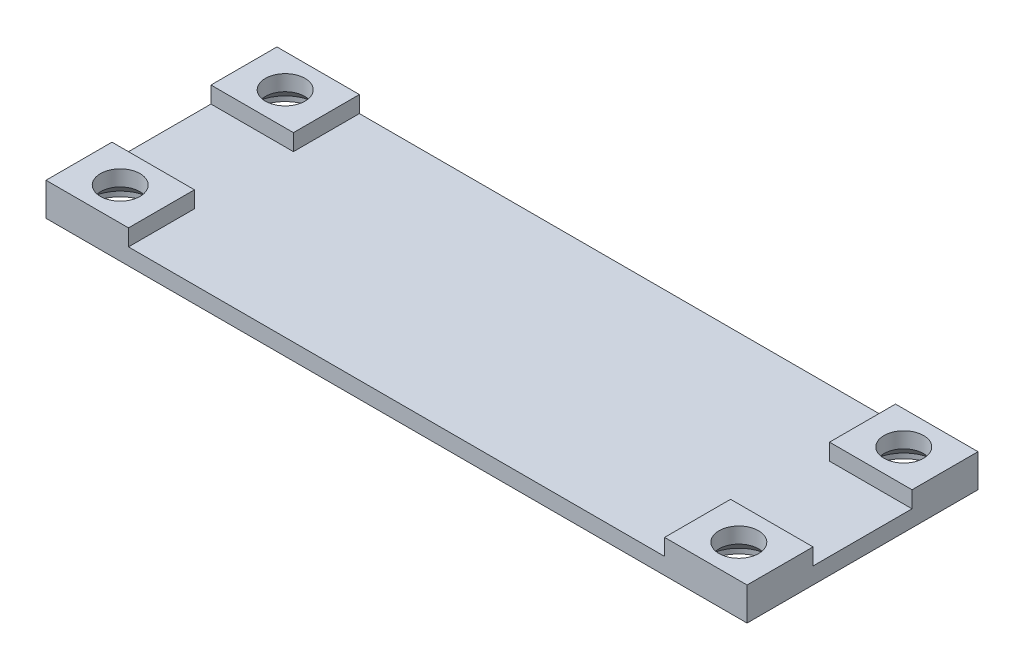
from build123d import *

# Parameters (mm, degrees)
SKETCH_1_W                 = 42.5
SKETCH_1_H                 = 14
EXTRUDE_1_DEPTH            = 1
SKETCH_2_W                 = 5
SKETCH_2_H                 = 4
EXTRUDE_2_DEPTH            = 1
HOLE_WIZARD_M26_AT_2_COUNT = 2
HOLE_WIZARD_M26_AT_2_PITCH = 10
HOLE_WIZARD_M26_AT_3_COUNT = 2
HOLE_WIZARD_M26_AT_3_PITCH = 16.772876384
HOLE_WIZARD_M26_AT_4_COUNT = 2
HOLE_WIZARD_M26_AT_4_PITCH = 38.810436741
HOLE_WIZARD_M26_AT_5_COUNT = 2
HOLE_WIZARD_M26_AT_5_PITCH = 37.5


with BuildPart() as part:
    # Sketch 1 → Extrude 1 (new body)
    with BuildSketch(Plane(origin=(0, 0, 0), x_dir=(1, 0, 0), z_dir=(0, 1, 0))):
        with Locations((21.25, 7)):
            Rectangle(SKETCH_1_W, SKETCH_1_H)
    extrude(amount=EXTRUDE_1_DEPTH)

    # Sketch 2 → Extrude 2 (add)
    with BuildSketch(Plane(origin=(0, 1, 0), x_dir=(1, 0, 0), z_dir=(0, 1, 0))):
        with Locations((2.5, 12)):
            Rectangle(SKETCH_2_W, SKETCH_2_H)
        with Locations((2.5, 2)):
            Rectangle(SKETCH_2_W, SKETCH_2_H)
        with Locations((40, 2)):
            Rectangle(SKETCH_2_W, SKETCH_2_H)
        with Locations((40, 12)):
            Rectangle(SKETCH_2_W, SKETCH_2_H)
    extrude(amount=EXTRUDE_2_DEPTH)

    # Sketch 3 → Hole Wizard M26 (revolve, cut)
    with BuildSketch(Plane(origin=(2.5, 0, -2), x_dir=(0, 0, -1), z_dir=(1, 0, 0))):
        Polygon((0, 0), (0, 2.000025), (1.2, 2.000025), (1.2, 1.05), (1.95, 0.3), (1.95, 0), align=None)
    hole_wizard_m26 = revolve(axis=Axis((2.5, -6.35, -2), (0, 1, 0)), mode=Mode.SUBTRACT)

    # Hole Wizard M26 at 2: Hole Wizard M26 ×2
    with Locations(*[(0, 0, -i * HOLE_WIZARD_M26_AT_2_PITCH) for i in range(1, HOLE_WIZARD_M26_AT_2_COUNT)]):
        add(hole_wizard_m26, mode=Mode.SUBTRACT)

    # Hole Wizard M26 at 3: Hole Wizard M26 ×2
    with Locations(*[Vector(-0.943355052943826, 0, 0.3317849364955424) * (i * HOLE_WIZARD_M26_AT_3_PITCH) for i in range(1, HOLE_WIZARD_M26_AT_3_COUNT)]):
        add(hole_wizard_m26, mode=Mode.SUBTRACT)

    # Hole Wizard M26 at 4: Hole Wizard M26 ×2
    with Locations(*[Vector(0.9662349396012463, 0, -0.25766265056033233) * (i * HOLE_WIZARD_M26_AT_4_PITCH) for i in range(1, HOLE_WIZARD_M26_AT_4_COUNT)]):
        add(hole_wizard_m26, mode=Mode.SUBTRACT)

    # Hole Wizard M26 at 5: Hole Wizard M26 ×2
    with Locations(*[(i * HOLE_WIZARD_M26_AT_5_PITCH, 0, 0) for i in range(1, HOLE_WIZARD_M26_AT_5_COUNT)]):
        add(hole_wizard_m26, mode=Mode.SUBTRACT)


solid = part.part
